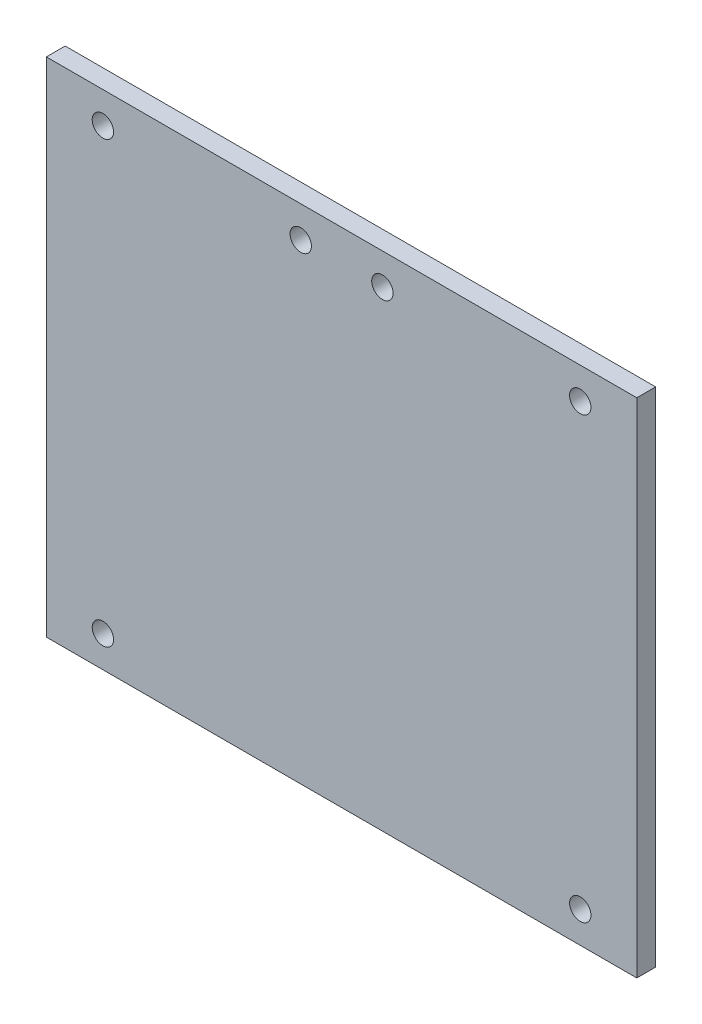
ISO-10303-21;
HEADER;
FILE_DESCRIPTION(('STEP AP214'),'2;1');
FILE_NAME('part.step','',(''),(''),'','','');
FILE_SCHEMA(('AUTOMOTIVE_DESIGN { 1 0 10303 214 1 1 1 1 }'));
ENDSEC;
DATA;
#1=APPLICATION_CONTEXT('core data for automotive mechanical design processes');
#2=APPLICATION_PROTOCOL_DEFINITION('international standard','automotive_design',2000,#1);
#3=PRODUCT_CONTEXT('',#1,'mechanical');
#4=PRODUCT('Part','Part','',(#3));
#5=PRODUCT_RELATED_PRODUCT_CATEGORY('part','',(#4));
#6=PRODUCT_DEFINITION_FORMATION('','',#4);
#7=PRODUCT_DEFINITION_CONTEXT('part definition',#1,'design');
#8=PRODUCT_DEFINITION('design','',#6,#7);
#9=PRODUCT_DEFINITION_SHAPE('','',#8);
#10=(LENGTH_UNIT() NAMED_UNIT(*) SI_UNIT(.MILLI.,.METRE.));
#11=(NAMED_UNIT(*) PLANE_ANGLE_UNIT() SI_UNIT($,.RADIAN.));
#12=(NAMED_UNIT(*) SI_UNIT($,.STERADIAN.) SOLID_ANGLE_UNIT());
#13=UNCERTAINTY_MEASURE_WITH_UNIT(LENGTH_MEASURE(1.E-05),#10,'distance_accuracy_value','');
#14=(GEOMETRIC_REPRESENTATION_CONTEXT(3) GLOBAL_UNCERTAINTY_ASSIGNED_CONTEXT((#13)) GLOBAL_UNIT_ASSIGNED_CONTEXT((#10,
#11,#12)) REPRESENTATION_CONTEXT('',''));
#15=CARTESIAN_POINT('',(0.,0.,0.));
#16=DIRECTION('',(0.,0.,1.));
#17=DIRECTION('',(1.,0.,0.));
#18=AXIS2_PLACEMENT_3D('',#15,#16,#17);
#19=CARTESIAN_POINT('',(47.,40.,3.));
#20=DIRECTION('',(-1.,0.,0.));
#21=DIRECTION('',(0.,-1.,0.));
#22=AXIS2_PLACEMENT_3D('',#19,#20,#21);
#23=PLANE('',#22);
#24=DIRECTION('',(0.,1.,0.));
#25=VECTOR('',#24,1.);
#26=CARTESIAN_POINT('',(47.,40.,0.));
#27=LINE('',#26,#25);
#28=CARTESIAN_POINT('',(47.,-40.,0.));
#29=VERTEX_POINT('',#28);
#30=CARTESIAN_POINT('',(47.,40.,0.));
#31=VERTEX_POINT('',#30);
#32=EDGE_CURVE('E97',#29,#31,#27,.T.);
#33=ORIENTED_EDGE('',*,*,#32,.T.);
#34=DIRECTION('',(0.,0.,-1.));
#35=VECTOR('',#34,1.);
#36=CARTESIAN_POINT('',(47.,40.,3.));
#37=LINE('',#36,#35);
#38=CARTESIAN_POINT('',(47.,40.,3.));
#39=VERTEX_POINT('',#38);
#40=EDGE_CURVE('E11',#39,#31,#37,.T.);
#41=ORIENTED_EDGE('',*,*,#40,.F.);
#42=DIRECTION('',(0.,1.,0.));
#43=VECTOR('',#42,1.);
#44=CARTESIAN_POINT('',(47.,40.,3.));
#45=LINE('',#44,#43);
#46=CARTESIAN_POINT('',(47.,-40.,3.));
#47=VERTEX_POINT('',#46);
#48=EDGE_CURVE('E85',#47,#39,#45,.T.);
#49=ORIENTED_EDGE('',*,*,#48,.F.);
#50=DIRECTION('',(0.,0.,-1.));
#51=VECTOR('',#50,1.);
#52=CARTESIAN_POINT('',(47.,-40.,3.));
#53=LINE('',#52,#51);
#54=EDGE_CURVE('E93',#47,#29,#53,.T.);
#55=ORIENTED_EDGE('',*,*,#54,.T.);
#56=EDGE_LOOP('',(#33,#41,#49,#55));
#57=FACE_BOUND('',#56,.T.);
#58=ADVANCED_FACE('F34',(#57),#23,.F.);
#59=CARTESIAN_POINT('',(-47.,40.,3.));
#60=DIRECTION('',(0.,-1.,0.));
#61=DIRECTION('',(0.,0.,-1.));
#62=AXIS2_PLACEMENT_3D('',#59,#60,#61);
#63=PLANE('',#62);
#64=DIRECTION('',(-1.,0.,0.));
#65=VECTOR('',#64,1.);
#66=CARTESIAN_POINT('',(-47.,40.,0.));
#67=LINE('',#66,#65);
#68=CARTESIAN_POINT('',(-47.,40.,0.));
#69=VERTEX_POINT('',#68);
#70=EDGE_CURVE('E89',#31,#69,#67,.T.);
#71=ORIENTED_EDGE('',*,*,#70,.T.);
#72=DIRECTION('',(0.,0.,-1.));
#73=VECTOR('',#72,1.);
#74=CARTESIAN_POINT('',(-47.,40.,3.));
#75=LINE('',#74,#73);
#76=CARTESIAN_POINT('',(-47.,40.,3.));
#77=VERTEX_POINT('',#76);
#78=EDGE_CURVE('E42',#77,#69,#75,.T.);
#79=ORIENTED_EDGE('',*,*,#78,.F.);
#80=DIRECTION('',(-1.,0.,0.));
#81=VECTOR('',#80,1.);
#82=CARTESIAN_POINT('',(-47.,40.,3.));
#83=LINE('',#82,#81);
#84=EDGE_CURVE('E80',#39,#77,#83,.T.);
#85=ORIENTED_EDGE('',*,*,#84,.F.);
#86=ORIENTED_EDGE('',*,*,#40,.T.);
#87=EDGE_LOOP('',(#71,#79,#85,#86));
#88=FACE_BOUND('',#87,.T.);
#89=ADVANCED_FACE('F88',(#88),#63,.F.);
#90=CARTESIAN_POINT('',(-47.,40.,3.));
#91=DIRECTION('',(1.,0.,0.));
#92=DIRECTION('',(0.,1.,0.));
#93=AXIS2_PLACEMENT_3D('',#90,#91,#92);
#94=PLANE('',#93);
#95=DIRECTION('',(0.,-1.,0.));
#96=VECTOR('',#95,1.);
#97=CARTESIAN_POINT('',(-47.,40.,0.));
#98=LINE('',#97,#96);
#99=CARTESIAN_POINT('',(-47.,-40.,0.));
#100=VERTEX_POINT('',#99);
#101=EDGE_CURVE('E67',#69,#100,#98,.T.);
#102=ORIENTED_EDGE('',*,*,#101,.T.);
#103=DIRECTION('',(0.,0.,-1.));
#104=VECTOR('',#103,1.);
#105=CARTESIAN_POINT('',(-47.,-40.,3.));
#106=LINE('',#105,#104);
#107=CARTESIAN_POINT('',(-47.,-40.,3.));
#108=VERTEX_POINT('',#107);
#109=EDGE_CURVE('E90',#108,#100,#106,.T.);
#110=ORIENTED_EDGE('',*,*,#109,.F.);
#111=DIRECTION('',(0.,-1.,0.));
#112=VECTOR('',#111,1.);
#113=CARTESIAN_POINT('',(-47.,40.,3.));
#114=LINE('',#113,#112);
#115=EDGE_CURVE('E83',#77,#108,#114,.T.);
#116=ORIENTED_EDGE('',*,*,#115,.F.);
#117=ORIENTED_EDGE('',*,*,#78,.T.);
#118=EDGE_LOOP('',(#102,#110,#116,#117));
#119=FACE_BOUND('',#118,.T.);
#120=ADVANCED_FACE('F91',(#119),#94,.F.);
#121=CARTESIAN_POINT('',(-47.,-40.,3.));
#122=DIRECTION('',(0.,1.,0.));
#123=DIRECTION('',(0.,0.,1.));
#124=AXIS2_PLACEMENT_3D('',#121,#122,#123);
#125=PLANE('',#124);
#126=DIRECTION('',(1.,0.,0.));
#127=VECTOR('',#126,1.);
#128=CARTESIAN_POINT('',(-47.,-40.,0.));
#129=LINE('',#128,#127);
#130=EDGE_CURVE('E73',#100,#29,#129,.T.);
#131=ORIENTED_EDGE('',*,*,#130,.T.);
#132=ORIENTED_EDGE('',*,*,#54,.F.);
#133=DIRECTION('',(1.,0.,0.));
#134=VECTOR('',#133,1.);
#135=CARTESIAN_POINT('',(-47.,-40.,3.));
#136=LINE('',#135,#134);
#137=EDGE_CURVE('E50',#108,#47,#136,.T.);
#138=ORIENTED_EDGE('',*,*,#137,.F.);
#139=ORIENTED_EDGE('',*,*,#109,.T.);
#140=EDGE_LOOP('',(#131,#132,#138,#139));
#141=FACE_BOUND('',#140,.T.);
#142=ADVANCED_FACE('F105',(#141),#125,.F.);
#143=CARTESIAN_POINT('',(0.,0.,3.));
#144=DIRECTION('',(0.,0.,1.));
#145=DIRECTION('',(1.,0.,0.));
#146=AXIS2_PLACEMENT_3D('',#143,#144,#145);
#147=PLANE('',#146);
#148=CARTESIAN_POINT('',(-38.,35.,3.));
#149=DIRECTION('',(0.,0.,1.));
#150=DIRECTION('',(1.,0.,0.));
#151=AXIS2_PLACEMENT_3D('',#148,#149,#150);
#152=CIRCLE('',#151,1.69999999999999);
#153=CARTESIAN_POINT('',(-36.3,35.,3.));
#154=VERTEX_POINT('',#153);
#155=EDGE_CURVE('E143',#154,#154,#152,.T.);
#156=ORIENTED_EDGE('',*,*,#155,.F.);
#157=EDGE_LOOP('',(#156));
#158=FACE_BOUND('',#157,.T.);
#159=CARTESIAN_POINT('',(38.,35.,3.));
#160=DIRECTION('',(0.,0.,1.));
#161=DIRECTION('',(1.,0.,0.));
#162=AXIS2_PLACEMENT_3D('',#159,#160,#161);
#163=CIRCLE('',#162,1.69999999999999);
#164=CARTESIAN_POINT('',(39.7,35.,3.));
#165=VERTEX_POINT('',#164);
#166=EDGE_CURVE('E137',#165,#165,#163,.T.);
#167=ORIENTED_EDGE('',*,*,#166,.F.);
#168=EDGE_LOOP('',(#167));
#169=FACE_BOUND('',#168,.T.);
#170=CARTESIAN_POINT('',(-38.,-35.,3.));
#171=DIRECTION('',(0.,0.,1.));
#172=DIRECTION('',(1.,0.,0.));
#173=AXIS2_PLACEMENT_3D('',#170,#171,#172);
#174=CIRCLE('',#173,1.69999999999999);
#175=CARTESIAN_POINT('',(-36.3,-35.,3.));
#176=VERTEX_POINT('',#175);
#177=EDGE_CURVE('E131',#176,#176,#174,.T.);
#178=ORIENTED_EDGE('',*,*,#177,.F.);
#179=EDGE_LOOP('',(#178));
#180=FACE_BOUND('',#179,.T.);
#181=CARTESIAN_POINT('',(38.,-35.,3.));
#182=DIRECTION('',(0.,0.,1.));
#183=DIRECTION('',(1.,0.,0.));
#184=AXIS2_PLACEMENT_3D('',#181,#182,#183);
#185=CIRCLE('',#184,1.69999999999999);
#186=CARTESIAN_POINT('',(39.7,-35.,3.));
#187=VERTEX_POINT('',#186);
#188=EDGE_CURVE('E125',#187,#187,#185,.T.);
#189=ORIENTED_EDGE('',*,*,#188,.F.);
#190=EDGE_LOOP('',(#189));
#191=FACE_BOUND('',#190,.T.);
#192=CARTESIAN_POINT('',(-6.5,35.0000000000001,3.));
#193=DIRECTION('',(0.,0.,1.));
#194=DIRECTION('',(1.,0.,0.));
#195=AXIS2_PLACEMENT_3D('',#192,#193,#194);
#196=CIRCLE('',#195,1.69999999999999);
#197=CARTESIAN_POINT('',(-4.80000000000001,35.0000000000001,3.));
#198=VERTEX_POINT('',#197);
#199=EDGE_CURVE('E119',#198,#198,#196,.T.);
#200=ORIENTED_EDGE('',*,*,#199,.F.);
#201=EDGE_LOOP('',(#200));
#202=FACE_BOUND('',#201,.T.);
#203=CARTESIAN_POINT('',(6.50000000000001,35.0000000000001,3.));
#204=DIRECTION('',(0.,0.,1.));
#205=DIRECTION('',(1.,0.,0.));
#206=AXIS2_PLACEMENT_3D('',#203,#204,#205);
#207=CIRCLE('',#206,1.69999999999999);
#208=CARTESIAN_POINT('',(8.19999999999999,35.0000000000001,3.));
#209=VERTEX_POINT('',#208);
#210=EDGE_CURVE('E113',#209,#209,#207,.T.);
#211=ORIENTED_EDGE('',*,*,#210,.F.);
#212=EDGE_LOOP('',(#211));
#213=FACE_BOUND('',#212,.T.);
#214=ORIENTED_EDGE('',*,*,#48,.T.);
#215=ORIENTED_EDGE('',*,*,#84,.T.);
#216=ORIENTED_EDGE('',*,*,#115,.T.);
#217=ORIENTED_EDGE('',*,*,#137,.T.);
#218=EDGE_LOOP('',(#214,#215,#216,#217));
#219=FACE_BOUND('',#218,.T.);
#220=ADVANCED_FACE('F81',(#158,#169,#180,#191,#202,#213,#219),#147,.T.);
#221=CARTESIAN_POINT('',(0.,0.,0.));
#222=DIRECTION('',(0.,0.,1.));
#223=DIRECTION('',(1.,0.,0.));
#224=AXIS2_PLACEMENT_3D('',#221,#222,#223);
#225=PLANE('',#224);
#226=CARTESIAN_POINT('',(-38.,35.,0.));
#227=DIRECTION('',(0.,0.,1.));
#228=DIRECTION('',(1.,0.,0.));
#229=AXIS2_PLACEMENT_3D('',#226,#227,#228);
#230=CIRCLE('',#229,1.7);
#231=CARTESIAN_POINT('',(-36.3,35.,0.));
#232=VERTEX_POINT('',#231);
#233=EDGE_CURVE('E140',#232,#232,#230,.T.);
#234=ORIENTED_EDGE('',*,*,#233,.T.);
#235=EDGE_LOOP('',(#234));
#236=FACE_BOUND('',#235,.T.);
#237=CARTESIAN_POINT('',(38.,35.,0.));
#238=DIRECTION('',(0.,0.,1.));
#239=DIRECTION('',(1.,0.,0.));
#240=AXIS2_PLACEMENT_3D('',#237,#238,#239);
#241=CIRCLE('',#240,1.7);
#242=CARTESIAN_POINT('',(39.7,35.,0.));
#243=VERTEX_POINT('',#242);
#244=EDGE_CURVE('E134',#243,#243,#241,.T.);
#245=ORIENTED_EDGE('',*,*,#244,.T.);
#246=EDGE_LOOP('',(#245));
#247=FACE_BOUND('',#246,.T.);
#248=CARTESIAN_POINT('',(-38.,-35.,0.));
#249=DIRECTION('',(0.,0.,1.));
#250=DIRECTION('',(1.,0.,0.));
#251=AXIS2_PLACEMENT_3D('',#248,#249,#250);
#252=CIRCLE('',#251,1.7);
#253=CARTESIAN_POINT('',(-36.3,-35.,0.));
#254=VERTEX_POINT('',#253);
#255=EDGE_CURVE('E128',#254,#254,#252,.T.);
#256=ORIENTED_EDGE('',*,*,#255,.T.);
#257=EDGE_LOOP('',(#256));
#258=FACE_BOUND('',#257,.T.);
#259=CARTESIAN_POINT('',(38.,-35.,0.));
#260=DIRECTION('',(0.,0.,1.));
#261=DIRECTION('',(1.,0.,0.));
#262=AXIS2_PLACEMENT_3D('',#259,#260,#261);
#263=CIRCLE('',#262,1.7);
#264=CARTESIAN_POINT('',(39.7,-35.,0.));
#265=VERTEX_POINT('',#264);
#266=EDGE_CURVE('E122',#265,#265,#263,.T.);
#267=ORIENTED_EDGE('',*,*,#266,.T.);
#268=EDGE_LOOP('',(#267));
#269=FACE_BOUND('',#268,.T.);
#270=CARTESIAN_POINT('',(-6.5,35.0000000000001,0.));
#271=DIRECTION('',(0.,0.,1.));
#272=DIRECTION('',(1.,0.,0.));
#273=AXIS2_PLACEMENT_3D('',#270,#271,#272);
#274=CIRCLE('',#273,1.7);
#275=CARTESIAN_POINT('',(-4.8,35.0000000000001,0.));
#276=VERTEX_POINT('',#275);
#277=EDGE_CURVE('E116',#276,#276,#274,.T.);
#278=ORIENTED_EDGE('',*,*,#277,.T.);
#279=EDGE_LOOP('',(#278));
#280=FACE_BOUND('',#279,.T.);
#281=CARTESIAN_POINT('',(6.50000000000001,35.0000000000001,0.));
#282=DIRECTION('',(0.,0.,1.));
#283=DIRECTION('',(1.,0.,0.));
#284=AXIS2_PLACEMENT_3D('',#281,#282,#283);
#285=CIRCLE('',#284,1.7);
#286=CARTESIAN_POINT('',(8.2,35.0000000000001,0.));
#287=VERTEX_POINT('',#286);
#288=EDGE_CURVE('E100',#287,#287,#285,.T.);
#289=ORIENTED_EDGE('',*,*,#288,.T.);
#290=EDGE_LOOP('',(#289));
#291=FACE_BOUND('',#290,.T.);
#292=ORIENTED_EDGE('',*,*,#32,.F.);
#293=ORIENTED_EDGE('',*,*,#130,.F.);
#294=ORIENTED_EDGE('',*,*,#101,.F.);
#295=ORIENTED_EDGE('',*,*,#70,.F.);
#296=EDGE_LOOP('',(#292,#293,#294,#295));
#297=FACE_BOUND('',#296,.T.);
#298=ADVANCED_FACE('F108',(#236,#247,#258,#269,#280,#291,#297),#225,.F.);
#299=CARTESIAN_POINT('',(6.50000000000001,35.0000000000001,3.));
#300=DIRECTION('',(0.,0.,1.));
#301=DIRECTION('',(1.,0.,0.));
#302=AXIS2_PLACEMENT_3D('',#299,#300,#301);
#303=CYLINDRICAL_SURFACE('',#302,1.69999999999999);
#304=ORIENTED_EDGE('',*,*,#288,.F.);
#305=EDGE_LOOP('',(#304));
#306=FACE_BOUND('',#305,.T.);
#307=ORIENTED_EDGE('',*,*,#210,.T.);
#308=EDGE_LOOP('',(#307));
#309=FACE_BOUND('',#308,.T.);
#310=ADVANCED_FACE('F162',(#306,#309),#303,.F.);
#311=CARTESIAN_POINT('',(-6.5,35.0000000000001,3.));
#312=DIRECTION('',(0.,0.,1.));
#313=DIRECTION('',(1.,0.,0.));
#314=AXIS2_PLACEMENT_3D('',#311,#312,#313);
#315=CYLINDRICAL_SURFACE('',#314,1.69999999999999);
#316=ORIENTED_EDGE('',*,*,#277,.F.);
#317=EDGE_LOOP('',(#316));
#318=FACE_BOUND('',#317,.T.);
#319=ORIENTED_EDGE('',*,*,#199,.T.);
#320=EDGE_LOOP('',(#319));
#321=FACE_BOUND('',#320,.T.);
#322=ADVANCED_FACE('F164',(#318,#321),#315,.F.);
#323=CARTESIAN_POINT('',(38.,-35.,3.));
#324=DIRECTION('',(0.,0.,1.));
#325=DIRECTION('',(1.,0.,0.));
#326=AXIS2_PLACEMENT_3D('',#323,#324,#325);
#327=CYLINDRICAL_SURFACE('',#326,1.69999999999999);
#328=ORIENTED_EDGE('',*,*,#266,.F.);
#329=EDGE_LOOP('',(#328));
#330=FACE_BOUND('',#329,.T.);
#331=ORIENTED_EDGE('',*,*,#188,.T.);
#332=EDGE_LOOP('',(#331));
#333=FACE_BOUND('',#332,.T.);
#334=ADVANCED_FACE('F171',(#330,#333),#327,.F.);
#335=CARTESIAN_POINT('',(-38.,-35.,3.));
#336=DIRECTION('',(0.,0.,1.));
#337=DIRECTION('',(1.,0.,0.));
#338=AXIS2_PLACEMENT_3D('',#335,#336,#337);
#339=CYLINDRICAL_SURFACE('',#338,1.69999999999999);
#340=ORIENTED_EDGE('',*,*,#255,.F.);
#341=EDGE_LOOP('',(#340));
#342=FACE_BOUND('',#341,.T.);
#343=ORIENTED_EDGE('',*,*,#177,.T.);
#344=EDGE_LOOP('',(#343));
#345=FACE_BOUND('',#344,.T.);
#346=ADVANCED_FACE('F210',(#342,#345),#339,.F.);
#347=CARTESIAN_POINT('',(38.,35.,3.));
#348=DIRECTION('',(0.,0.,1.));
#349=DIRECTION('',(1.,0.,0.));
#350=AXIS2_PLACEMENT_3D('',#347,#348,#349);
#351=CYLINDRICAL_SURFACE('',#350,1.69999999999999);
#352=ORIENTED_EDGE('',*,*,#244,.F.);
#353=EDGE_LOOP('',(#352));
#354=FACE_BOUND('',#353,.T.);
#355=ORIENTED_EDGE('',*,*,#166,.T.);
#356=EDGE_LOOP('',(#355));
#357=FACE_BOUND('',#356,.T.);
#358=ADVANCED_FACE('F221',(#354,#357),#351,.F.);
#359=CARTESIAN_POINT('',(-38.,35.,3.));
#360=DIRECTION('',(0.,0.,1.));
#361=DIRECTION('',(1.,0.,0.));
#362=AXIS2_PLACEMENT_3D('',#359,#360,#361);
#363=CYLINDRICAL_SURFACE('',#362,1.69999999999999);
#364=ORIENTED_EDGE('',*,*,#233,.F.);
#365=EDGE_LOOP('',(#364));
#366=FACE_BOUND('',#365,.T.);
#367=ORIENTED_EDGE('',*,*,#155,.T.);
#368=EDGE_LOOP('',(#367));
#369=FACE_BOUND('',#368,.T.);
#370=ADVANCED_FACE('F147',(#366,#369),#363,.F.);
#371=CLOSED_SHELL('',(#58,#89,#120,#142,#220,#298,#310,#322,#334,#346,#358,#370));
#372=MANIFOLD_SOLID_BREP('B2',#371);
#373=ADVANCED_BREP_SHAPE_REPRESENTATION('',(#18,#372),#14);
#374=SHAPE_DEFINITION_REPRESENTATION(#9,#373);
ENDSEC;
END-ISO-10303-21;
